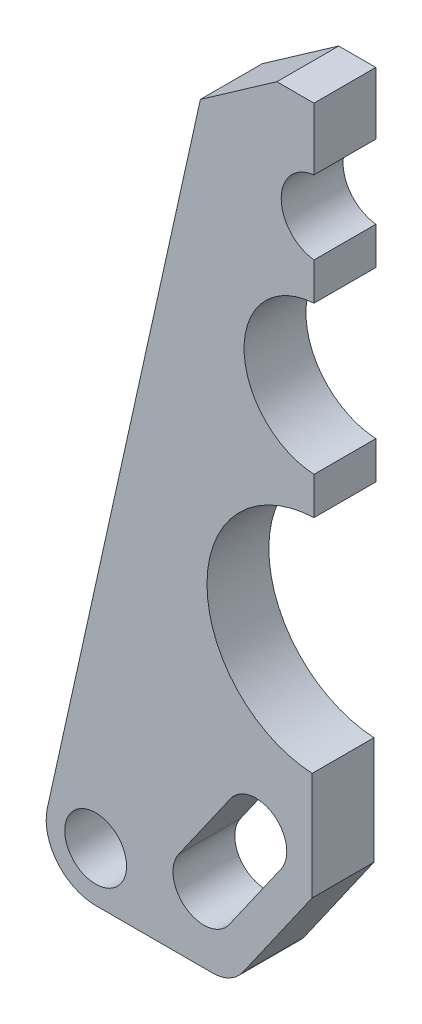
from build123d import *

# Parameters (mm, degrees)
SKETCH1_R          = 2.5
BASE_EXTRUDE_DEPTH = 5
FILLET1_R          = 3


with BuildPart() as part:
    # Sketch1 → Base-Extrude (new body)
    with BuildSketch(Plane.XY):
        with BuildLine():
            Line((-0.35, 46.020486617), (-0.35, 42.989782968))
            ThreePointArc((-0.35, 42.989782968), (-6, 37), (-0.35, 31.010217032))
            Line((-0.35, 31.010217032), (-0.35, 27.979513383))
            ThreePointArc((-0.35, 27.979513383), (-8.999686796, 19.061405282), (-0.5, 10.000221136))
            Line((-0.5, 10.000221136), (-0.5, 1.279061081))
            Line((-0.5, 1.279061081), (-6.997268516, -8))
            Line((-6.997268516, -8), (-18, -8))
            ThreePointArc((-18, -8), (-21.119537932, -6.503693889), (-21.905184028, -3.134241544))
            Line((-21.905184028, -3.134241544), (-9.533644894, 52.670165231))
            Line((-9.533644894, 52.670165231), (-3.35, 57))
            Line((-3.35, 57), (-0.35, 57))
            Line((-0.35, 57), (-0.35, 51.979513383))
            ThreePointArc((-0.35, 51.979513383), (-3, 49), (-0.35, 46.020486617))
        make_face()
        with Locations((-18, -4)):
            Circle(SKETCH1_R, mode=Mode.SUBTRACT)
        with BuildLine():
            Line((-11.297880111, -1.066058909), (-7.096634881, 4.933941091))
            ThreePointArc((-7.096634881, 4.933941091), (-3.61481368, 5.547880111), (-3.00087466, 2.066058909))
            Line((-3.00087466, 2.066058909), (-7.202119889, -3.933941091))
            ThreePointArc((-7.202119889, -3.933941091), (-10.683941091, -4.547880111), (-11.297880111, -1.066058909))
        make_face(mode=Mode.SUBTRACT)
    extrude(amount=BASE_EXTRUDE_DEPTH)

    # Fillet1
    fillet1_edges = [part.edges().sort_by_distance(p)[0] for p in [
        (-6.997268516, -8, 2.5),
    ]]
    fillet(fillet1_edges, radius=FILLET1_R)


solid = part.part
